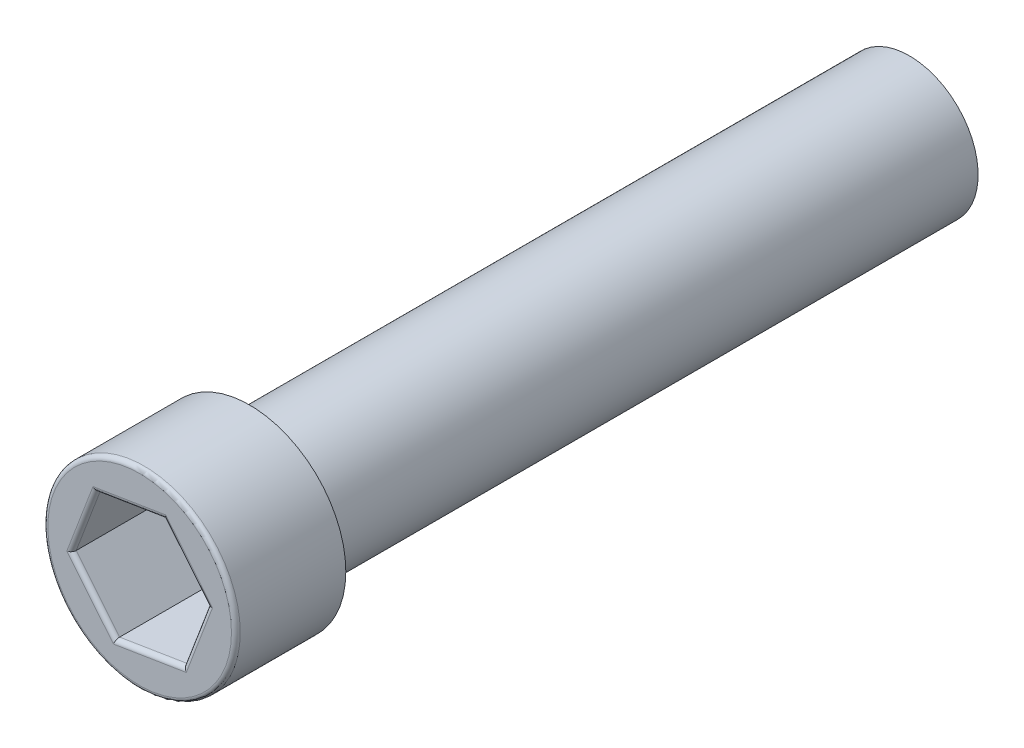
ISO-10303-21;
HEADER;
FILE_DESCRIPTION(('STEP AP214'),'2;1');
FILE_NAME('part.step','',(''),(''),'','','');
FILE_SCHEMA(('AUTOMOTIVE_DESIGN { 1 0 10303 214 1 1 1 1 }'));
ENDSEC;
DATA;
#1=APPLICATION_CONTEXT('core data for automotive mechanical design processes');
#2=APPLICATION_PROTOCOL_DEFINITION('international standard','automotive_design',2000,#1);
#3=PRODUCT_CONTEXT('',#1,'mechanical');
#4=PRODUCT('Part','Part','',(#3));
#5=PRODUCT_RELATED_PRODUCT_CATEGORY('part','',(#4));
#6=PRODUCT_DEFINITION_FORMATION('','',#4);
#7=PRODUCT_DEFINITION_CONTEXT('part definition',#1,'design');
#8=PRODUCT_DEFINITION('design','',#6,#7);
#9=PRODUCT_DEFINITION_SHAPE('','',#8);
#10=(LENGTH_UNIT() NAMED_UNIT(*) SI_UNIT(.MILLI.,.METRE.));
#11=(NAMED_UNIT(*) PLANE_ANGLE_UNIT() SI_UNIT($,.RADIAN.));
#12=(NAMED_UNIT(*) SI_UNIT($,.STERADIAN.) SOLID_ANGLE_UNIT());
#13=UNCERTAINTY_MEASURE_WITH_UNIT(LENGTH_MEASURE(1.E-05),#10,'distance_accuracy_value','');
#14=(GEOMETRIC_REPRESENTATION_CONTEXT(3) GLOBAL_UNCERTAINTY_ASSIGNED_CONTEXT((#13)) GLOBAL_UNIT_ASSIGNED_CONTEXT((#10,
#11,#12)) REPRESENTATION_CONTEXT('',''));
#15=CARTESIAN_POINT('',(0.,0.,0.));
#16=DIRECTION('',(0.,0.,1.));
#17=DIRECTION('',(1.,0.,0.));
#18=AXIS2_PLACEMENT_3D('',#15,#16,#17);
#19=CARTESIAN_POINT('',(0.,0.,44.45));
#20=DIRECTION('',(0.,0.,1.));
#21=DIRECTION('',(1.,0.,0.));
#22=AXIS2_PLACEMENT_3D('',#19,#20,#21);
#23=PLANE('',#22);
#24=DIRECTION('',(-0.354797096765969,-0.934943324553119,0.));
#25=VECTOR('',#24,1.);
#26=CARTESIAN_POINT('',(3.45091163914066,-1.30956968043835,44.45));
#27=LINE('',#26,#25);
#28=CARTESIAN_POINT('',(4.20699204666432,0.682815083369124,44.45));
#29=VERTEX_POINT('',#28);
#30=CARTESIAN_POINT('',(2.69483123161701,-3.30195444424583,44.45));
#31=VERTEX_POINT('',#30);
#32=EDGE_CURVE('E201',#29,#31,#27,.T.);
#33=ORIENTED_EDGE('',*,*,#32,.T.);
#34=DIRECTION('',(-0.987083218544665,-0.160208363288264,0.));
#35=VECTOR('',#34,1.);
#36=CARTESIAN_POINT('',(0.591335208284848,-3.64336198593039,44.45));
#37=LINE('',#36,#35);
#38=CARTESIAN_POINT('',(-1.51216081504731,-3.98476952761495,44.45));
#39=VERTEX_POINT('',#38);
#40=EDGE_CURVE('E204',#31,#39,#37,.T.);
#41=ORIENTED_EDGE('',*,*,#40,.T.);
#42=DIRECTION('',(-0.632286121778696,0.774734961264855,0.));
#43=VECTOR('',#42,1.);
#44=CARTESIAN_POINT('',(-2.85957643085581,-2.33379230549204,44.45));
#45=LINE('',#44,#43);
#46=CARTESIAN_POINT('',(-4.20699204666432,-0.682815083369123,44.45));
#47=VERTEX_POINT('',#46);
#48=EDGE_CURVE('E189',#39,#47,#45,.T.);
#49=ORIENTED_EDGE('',*,*,#48,.T.);
#50=DIRECTION('',(0.354797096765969,0.934943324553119,0.));
#51=VECTOR('',#50,1.);
#52=CARTESIAN_POINT('',(-3.45091163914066,1.30956968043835,44.45));
#53=LINE('',#52,#51);
#54=CARTESIAN_POINT('',(-2.69483123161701,3.30195444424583,44.45));
#55=VERTEX_POINT('',#54);
#56=EDGE_CURVE('E192',#47,#55,#53,.T.);
#57=ORIENTED_EDGE('',*,*,#56,.T.);
#58=DIRECTION('',(0.987083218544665,0.160208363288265,0.));
#59=VECTOR('',#58,1.);
#60=CARTESIAN_POINT('',(-0.59133520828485,3.64336198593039,44.45));
#61=LINE('',#60,#59);
#62=CARTESIAN_POINT('',(1.51216081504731,3.98476952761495,44.45));
#63=VERTEX_POINT('',#62);
#64=EDGE_CURVE('E195',#55,#63,#61,.T.);
#65=ORIENTED_EDGE('',*,*,#64,.T.);
#66=DIRECTION('',(0.632286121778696,-0.774734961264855,0.));
#67=VECTOR('',#66,1.);
#68=CARTESIAN_POINT('',(2.85957643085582,2.33379230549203,44.45));
#69=LINE('',#68,#67);
#70=EDGE_CURVE('E198',#63,#29,#69,.T.);
#71=ORIENTED_EDGE('',*,*,#70,.T.);
#72=EDGE_LOOP('',(#33,#41,#49,#57,#65,#71));
#73=FACE_BOUND('',#72,.T.);
#74=CARTESIAN_POINT('',(0.,0.,44.45));
#75=DIRECTION('',(0.,0.,1.));
#76=DIRECTION('',(1.,0.,0.));
#77=AXIS2_PLACEMENT_3D('',#74,#75,#76);
#78=CIRCLE('',#77,5.30225);
#79=CARTESIAN_POINT('',(5.30225,0.,44.45));
#80=VERTEX_POINT('',#79);
#81=EDGE_CURVE('E178',#80,#80,#78,.T.);
#82=ORIENTED_EDGE('',*,*,#81,.T.);
#83=EDGE_LOOP('',(#82));
#84=FACE_BOUND('',#83,.T.);
#85=ADVANCED_FACE('F42',(#73,#84),#23,.T.);
#86=CARTESIAN_POINT('',(0.,0.,38.1));
#87=DIRECTION('',(0.,0.,-1.));
#88=DIRECTION('',(-1.,0.,0.));
#89=AXIS2_PLACEMENT_3D('',#86,#87,#88);
#90=CYLINDRICAL_SURFACE('',#89,3.96875);
#91=CARTESIAN_POINT('',(0.,0.,38.1));
#92=DIRECTION('',(0.,0.,1.));
#93=DIRECTION('',(1.,0.,0.));
#94=AXIS2_PLACEMENT_3D('',#91,#92,#93);
#95=CIRCLE('',#94,3.96875);
#96=CARTESIAN_POINT('',(-3.96875,0.,38.1));
#97=VERTEX_POINT('',#96);
#98=EDGE_CURVE('E174',#97,#97,#95,.T.);
#99=CARTESIAN_POINT('',(0.,0.,0.));
#100=DIRECTION('',(0.,0.,1.));
#101=DIRECTION('',(1.,0.,0.));
#102=AXIS2_PLACEMENT_3D('',#99,#100,#101);
#103=CIRCLE('',#102,3.96875);
#104=CARTESIAN_POINT('',(-3.96875,0.,0.));
#105=VERTEX_POINT('',#104);
#106=EDGE_CURVE('E173',#105,#105,#103,.T.);
#107=CARTESIAN_POINT('',(-3.96875,0.,38.1));
#108=CARTESIAN_POINT('',(-3.96875,0.,37.703125));
#109=CARTESIAN_POINT('',(-3.96875,0.,37.30625));
#110=CARTESIAN_POINT('',(-3.96875,0.,36.5125));
#111=CARTESIAN_POINT('',(-3.96875,0.,36.115625));
#112=CARTESIAN_POINT('',(-3.96875,0.,35.321875));
#113=CARTESIAN_POINT('',(-3.96875,0.,34.925));
#114=CARTESIAN_POINT('',(-3.96875,0.,34.13125));
#115=CARTESIAN_POINT('',(-3.96875,0.,33.734375));
#116=CARTESIAN_POINT('',(-3.96875,0.,32.940625));
#117=CARTESIAN_POINT('',(-3.96875,0.,32.54375));
#118=CARTESIAN_POINT('',(-3.96875,0.,31.75));
#119=CARTESIAN_POINT('',(-3.96875,0.,31.353125));
#120=CARTESIAN_POINT('',(-3.96875,0.,30.559375));
#121=CARTESIAN_POINT('',(-3.96875,0.,30.1625));
#122=CARTESIAN_POINT('',(-3.96875,0.,29.36875));
#123=CARTESIAN_POINT('',(-3.96875,0.,28.971875));
#124=CARTESIAN_POINT('',(-3.96875,0.,28.178125));
#125=CARTESIAN_POINT('',(-3.96875,0.,27.78125));
#126=CARTESIAN_POINT('',(-3.96875,0.,26.9875));
#127=CARTESIAN_POINT('',(-3.96875,0.,26.590625));
#128=CARTESIAN_POINT('',(-3.96875,0.,25.796875));
#129=CARTESIAN_POINT('',(-3.96875,0.,25.4));
#130=CARTESIAN_POINT('',(-3.96875,0.,24.60625));
#131=CARTESIAN_POINT('',(-3.96875,0.,24.209375));
#132=CARTESIAN_POINT('',(-3.96875,0.,23.415625));
#133=CARTESIAN_POINT('',(-3.96875,0.,23.01875));
#134=CARTESIAN_POINT('',(-3.96875,0.,22.225));
#135=CARTESIAN_POINT('',(-3.96875,0.,21.828125));
#136=CARTESIAN_POINT('',(-3.96875,0.,21.034375));
#137=CARTESIAN_POINT('',(-3.96875,0.,20.6375));
#138=CARTESIAN_POINT('',(-3.96875,0.,19.84375));
#139=CARTESIAN_POINT('',(-3.96875,0.,19.446875));
#140=CARTESIAN_POINT('',(-3.96875,0.,18.653125));
#141=CARTESIAN_POINT('',(-3.96875,0.,18.25625));
#142=CARTESIAN_POINT('',(-3.96875,0.,17.4625));
#143=CARTESIAN_POINT('',(-3.96875,0.,17.065625));
#144=CARTESIAN_POINT('',(-3.96875,0.,16.271875));
#145=CARTESIAN_POINT('',(-3.96875,0.,15.875));
#146=CARTESIAN_POINT('',(-3.96875,0.,15.08125));
#147=CARTESIAN_POINT('',(-3.96875,0.,14.684375));
#148=CARTESIAN_POINT('',(-3.96875,0.,13.890625));
#149=CARTESIAN_POINT('',(-3.96875,0.,13.49375));
#150=CARTESIAN_POINT('',(-3.96875,0.,12.7));
#151=CARTESIAN_POINT('',(-3.96875,0.,12.303125));
#152=CARTESIAN_POINT('',(-3.96875,0.,11.509375));
#153=CARTESIAN_POINT('',(-3.96875,0.,11.1125));
#154=CARTESIAN_POINT('',(-3.96875,0.,10.31875));
#155=CARTESIAN_POINT('',(-3.96875,0.,9.921875));
#156=CARTESIAN_POINT('',(-3.96875,0.,9.128125));
#157=CARTESIAN_POINT('',(-3.96875,0.,8.73125));
#158=CARTESIAN_POINT('',(-3.96875,0.,7.9375));
#159=CARTESIAN_POINT('',(-3.96875,0.,7.540625));
#160=CARTESIAN_POINT('',(-3.96875,0.,6.746875));
#161=CARTESIAN_POINT('',(-3.96875,0.,6.35));
#162=CARTESIAN_POINT('',(-3.96875,0.,5.55625));
#163=CARTESIAN_POINT('',(-3.96875,0.,5.159375));
#164=CARTESIAN_POINT('',(-3.96875,0.,4.365625));
#165=CARTESIAN_POINT('',(-3.96875,0.,3.96875));
#166=CARTESIAN_POINT('',(-3.96875,0.,3.175));
#167=CARTESIAN_POINT('',(-3.96875,0.,2.778125));
#168=CARTESIAN_POINT('',(-3.96875,0.,1.984375));
#169=CARTESIAN_POINT('',(-3.96875,0.,1.5875));
#170=CARTESIAN_POINT('',(-3.96875,0.,0.79375));
#171=CARTESIAN_POINT('',(-3.96875,0.,0.396875));
#172=CARTESIAN_POINT('',(-3.96875,0.,0.));
#173=B_SPLINE_CURVE_WITH_KNOTS('',3,(#107,#108,#109,#110,#111,#112,#113,#114,#115,#116,#117,
#118,#119,#120,#121,#122,#123,#124,#125,#126,#127,#128,#129,#130,#131,#132,#133,#134,#135,#136,
#137,#138,#139,#140,#141,#142,#143,#144,#145,#146,#147,#148,#149,#150,#151,#152,#153,#154,#155,
#156,#157,#158,#159,#160,#161,#162,#163,#164,#165,#166,#167,#168,#169,#170,#171,#172),
.UNSPECIFIED.,.F.,.F.,(4,2,2,2,2,2,2,2,2,2,2,2,2,2,2,2,2,2,2,2,2,2,2,2,2,2,2,2,2,2,2,2,4),(0.,
1.19062499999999,2.38124999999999,3.571875,4.7625,5.953125,7.14375,8.33437499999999,9.525,
10.715625,11.90625,13.096875,14.2875,15.478125,16.66875,17.859375,19.05,20.240625,21.43125,
22.621875,23.8125,25.003125,26.19375,27.384375,28.575,29.765625,30.95625,32.146875,33.3375,
34.528125,35.71875,36.909375,38.1),.UNSPECIFIED.);
#174=EDGE_CURVE('BSEAM283',#97,#105,#173,.T.);
#175=ORIENTED_EDGE('',*,*,#98,.F.);
#176=ORIENTED_EDGE('',*,*,#106,.T.);
#177=ORIENTED_EDGE('',*,*,#174,.T.);
#178=ORIENTED_EDGE('',*,*,#174,.F.);
#179=EDGE_LOOP('',(#175,#177,#176,#178));
#180=FACE_BOUND('',#179,.T.);
#181=ADVANCED_FACE('F283',(#180),#90,.T.);
#182=CARTESIAN_POINT('',(0.,0.,0.));
#183=DIRECTION('',(0.,0.,1.));
#184=DIRECTION('',(1.,0.,0.));
#185=AXIS2_PLACEMENT_3D('',#182,#183,#184);
#186=PLANE('',#185);
#187=ORIENTED_EDGE('',*,*,#106,.F.);
#188=EDGE_LOOP('',(#187));
#189=FACE_BOUND('',#188,.T.);
#190=ADVANCED_FACE('F288',(#189),#186,.F.);
#191=CARTESIAN_POINT('',(0.,0.,44.45));
#192=DIRECTION('',(0.,0.,-1.));
#193=DIRECTION('',(-1.,0.,0.));
#194=AXIS2_PLACEMENT_3D('',#191,#192,#193);
#195=CYLINDRICAL_SURFACE('',#194,5.55625);
#196=CARTESIAN_POINT('',(0.,0.,44.196));
#197=DIRECTION('',(0.,0.,1.));
#198=DIRECTION('',(1.,0.,0.));
#199=AXIS2_PLACEMENT_3D('',#196,#197,#198);
#200=CIRCLE('',#199,5.55625);
#201=CARTESIAN_POINT('',(5.55625,0.,44.196));
#202=VERTEX_POINT('',#201);
#203=EDGE_CURVE('E185',#202,#202,#200,.F.);
#204=ORIENTED_EDGE('',*,*,#203,.T.);
#205=EDGE_LOOP('',(#204));
#206=FACE_BOUND('',#205,.T.);
#207=CARTESIAN_POINT('',(0.,0.,38.1));
#208=DIRECTION('',(0.,0.,1.));
#209=DIRECTION('',(1.,0.,0.));
#210=AXIS2_PLACEMENT_3D('',#207,#208,#209);
#211=CIRCLE('',#210,5.55625);
#212=CARTESIAN_POINT('',(5.55625,0.,38.1));
#213=VERTEX_POINT('',#212);
#214=EDGE_CURVE('E156',#213,#213,#211,.T.);
#215=ORIENTED_EDGE('',*,*,#214,.T.);
#216=EDGE_LOOP('',(#215));
#217=FACE_BOUND('',#216,.T.);
#218=ADVANCED_FACE('F297',(#206,#217),#195,.T.);
#219=CARTESIAN_POINT('',(0.,0.,38.1));
#220=DIRECTION('',(0.,0.,1.));
#221=DIRECTION('',(1.,0.,0.));
#222=AXIS2_PLACEMENT_3D('',#219,#220,#221);
#223=PLANE('',#222);
#224=ORIENTED_EDGE('',*,*,#98,.T.);
#225=EDGE_LOOP('',(#224));
#226=FACE_BOUND('',#225,.T.);
#227=ORIENTED_EDGE('',*,*,#214,.F.);
#228=EDGE_LOOP('',(#227));
#229=FACE_BOUND('',#228,.T.);
#230=ADVANCED_FACE('F294',(#226,#229),#223,.F.);
#231=CARTESIAN_POINT('',(-3.21343603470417,1.2194512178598,39.37));
#232=DIRECTION('',(0.934943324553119,-0.354797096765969,0.));
#233=DIRECTION('',(0.354797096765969,0.934943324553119,0.));
#234=AXIS2_PLACEMENT_3D('',#231,#232,#233);
#235=PLANE('',#234);
#236=DIRECTION('',(0.,0.,1.));
#237=VECTOR('',#236,1.);
#238=CARTESIAN_POINT('',(-2.5093855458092,3.07472937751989,39.37));
#239=LINE('',#238,#237);
#240=CARTESIAN_POINT('',(-2.5093855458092,3.07472937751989,39.37));
#241=VERTEX_POINT('',#240);
#242=CARTESIAN_POINT('',(-2.5093855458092,3.07472937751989,44.196));
#243=VERTEX_POINT('',#242);
#244=EDGE_CURVE('E153',#241,#243,#239,.T.);
#245=ORIENTED_EDGE('',*,*,#244,.T.);
#246=DIRECTION('',(0.354797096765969,0.934943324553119,0.));
#247=VECTOR('',#246,1.);
#248=CARTESIAN_POINT('',(-3.21343603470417,1.2194512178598,44.196));
#249=LINE('',#248,#247);
#250=CARTESIAN_POINT('',(-3.91748652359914,-0.6358269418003,44.196));
#251=VERTEX_POINT('',#250);
#252=EDGE_CURVE('E52',#243,#251,#249,.F.);
#253=ORIENTED_EDGE('',*,*,#252,.T.);
#254=DIRECTION('',(0.,0.,1.));
#255=VECTOR('',#254,1.);
#256=CARTESIAN_POINT('',(-3.91748652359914,-0.6358269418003,39.37));
#257=LINE('',#256,#255);
#258=CARTESIAN_POINT('',(-3.91748652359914,-0.6358269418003,39.37));
#259=VERTEX_POINT('',#258);
#260=EDGE_CURVE('E119',#259,#251,#257,.T.);
#261=ORIENTED_EDGE('',*,*,#260,.F.);
#262=DIRECTION('',(0.354797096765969,0.934943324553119,0.));
#263=VECTOR('',#262,1.);
#264=CARTESIAN_POINT('',(-3.21343603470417,1.2194512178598,39.37));
#265=LINE('',#264,#263);
#266=EDGE_CURVE('E128',#259,#241,#265,.T.);
#267=ORIENTED_EDGE('',*,*,#266,.T.);
#268=EDGE_LOOP('',(#245,#253,#261,#267));
#269=FACE_BOUND('',#268,.T.);
#270=ADVANCED_FACE('F131',(#269),#235,.T.);
#271=CARTESIAN_POINT('',(-0.55064228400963,3.39264284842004,39.37));
#272=DIRECTION('',(0.160208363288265,-0.987083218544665,0.));
#273=DIRECTION('',(0.987083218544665,0.160208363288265,0.));
#274=AXIS2_PLACEMENT_3D('',#271,#272,#273);
#275=PLANE('',#274);
#276=DIRECTION('',(0.,0.,1.));
#277=VECTOR('',#276,1.);
#278=CARTESIAN_POINT('',(1.40810097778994,3.71055631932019,39.37));
#279=LINE('',#278,#277);
#280=CARTESIAN_POINT('',(1.40810097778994,3.71055631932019,39.37));
#281=VERTEX_POINT('',#280);
#282=CARTESIAN_POINT('',(1.40810097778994,3.71055631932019,44.196));
#283=VERTEX_POINT('',#282);
#284=EDGE_CURVE('E157',#281,#283,#279,.T.);
#285=ORIENTED_EDGE('',*,*,#284,.T.);
#286=DIRECTION('',(0.987083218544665,0.160208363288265,0.));
#287=VECTOR('',#286,1.);
#288=CARTESIAN_POINT('',(-0.55064228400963,3.39264284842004,44.196));
#289=LINE('',#288,#287);
#290=EDGE_CURVE('E67',#283,#243,#289,.F.);
#291=ORIENTED_EDGE('',*,*,#290,.T.);
#292=ORIENTED_EDGE('',*,*,#244,.F.);
#293=DIRECTION('',(0.987083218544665,0.160208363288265,0.));
#294=VECTOR('',#293,1.);
#295=CARTESIAN_POINT('',(-0.55064228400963,3.39264284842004,39.37));
#296=LINE('',#295,#294);
#297=EDGE_CURVE('E133',#241,#281,#296,.T.);
#298=ORIENTED_EDGE('',*,*,#297,.T.);
#299=EDGE_LOOP('',(#285,#291,#292,#298));
#300=FACE_BOUND('',#299,.T.);
#301=ADVANCED_FACE('F409',(#300),#275,.T.);
#302=CARTESIAN_POINT('',(2.66279375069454,2.17319163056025,39.37));
#303=DIRECTION('',(-0.774734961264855,-0.632286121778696,0.));
#304=DIRECTION('',(0.632286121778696,-0.774734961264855,0.));
#305=AXIS2_PLACEMENT_3D('',#302,#303,#304);
#306=PLANE('',#305);
#307=DIRECTION('',(0.,0.,1.));
#308=VECTOR('',#307,1.);
#309=CARTESIAN_POINT('',(3.91748652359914,0.6358269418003,39.37));
#310=LINE('',#309,#308);
#311=CARTESIAN_POINT('',(3.91748652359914,0.6358269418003,39.37));
#312=VERTEX_POINT('',#311);
#313=CARTESIAN_POINT('',(3.91748652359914,0.6358269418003,44.196));
#314=VERTEX_POINT('',#313);
#315=EDGE_CURVE('E160',#312,#314,#310,.T.);
#316=ORIENTED_EDGE('',*,*,#315,.T.);
#317=DIRECTION('',(0.632286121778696,-0.774734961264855,0.));
#318=VECTOR('',#317,1.);
#319=CARTESIAN_POINT('',(2.66279375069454,2.17319163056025,44.196));
#320=LINE('',#319,#318);
#321=EDGE_CURVE('E215',#314,#283,#320,.F.);
#322=ORIENTED_EDGE('',*,*,#321,.T.);
#323=ORIENTED_EDGE('',*,*,#284,.F.);
#324=DIRECTION('',(0.632286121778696,-0.774734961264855,0.));
#325=VECTOR('',#324,1.);
#326=CARTESIAN_POINT('',(2.66279375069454,2.17319163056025,39.37));
#327=LINE('',#326,#325);
#328=EDGE_CURVE('E148',#281,#312,#327,.T.);
#329=ORIENTED_EDGE('',*,*,#328,.T.);
#330=EDGE_LOOP('',(#316,#322,#323,#329));
#331=FACE_BOUND('',#330,.T.);
#332=ADVANCED_FACE('F271',(#331),#306,.T.);
#333=CARTESIAN_POINT('',(3.21343603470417,-1.2194512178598,39.37));
#334=DIRECTION('',(-0.934943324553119,0.354797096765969,0.));
#335=DIRECTION('',(-0.354797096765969,-0.934943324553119,0.));
#336=AXIS2_PLACEMENT_3D('',#333,#334,#335);
#337=PLANE('',#336);
#338=DIRECTION('',(0.,0.,1.));
#339=VECTOR('',#338,1.);
#340=CARTESIAN_POINT('',(2.5093855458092,-3.07472937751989,39.37));
#341=LINE('',#340,#339);
#342=CARTESIAN_POINT('',(2.5093855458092,-3.07472937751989,39.37));
#343=VERTEX_POINT('',#342);
#344=CARTESIAN_POINT('',(2.5093855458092,-3.07472937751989,44.196));
#345=VERTEX_POINT('',#344);
#346=EDGE_CURVE('E164',#343,#345,#341,.T.);
#347=ORIENTED_EDGE('',*,*,#346,.T.);
#348=DIRECTION('',(-0.354797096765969,-0.934943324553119,0.));
#349=VECTOR('',#348,1.);
#350=CARTESIAN_POINT('',(3.21343603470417,-1.2194512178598,44.196));
#351=LINE('',#350,#349);
#352=EDGE_CURVE('E212',#345,#314,#351,.F.);
#353=ORIENTED_EDGE('',*,*,#352,.T.);
#354=ORIENTED_EDGE('',*,*,#315,.F.);
#355=DIRECTION('',(-0.354797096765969,-0.934943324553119,0.));
#356=VECTOR('',#355,1.);
#357=CARTESIAN_POINT('',(3.21343603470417,-1.2194512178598,39.37));
#358=LINE('',#357,#356);
#359=EDGE_CURVE('E145',#312,#343,#358,.T.);
#360=ORIENTED_EDGE('',*,*,#359,.T.);
#361=EDGE_LOOP('',(#347,#353,#354,#360));
#362=FACE_BOUND('',#361,.T.);
#363=ADVANCED_FACE('F267',(#362),#337,.T.);
#364=CARTESIAN_POINT('',(0.550642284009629,-3.39264284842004,39.37));
#365=DIRECTION('',(-0.160208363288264,0.987083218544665,0.));
#366=DIRECTION('',(-0.987083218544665,-0.160208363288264,0.));
#367=AXIS2_PLACEMENT_3D('',#364,#365,#366);
#368=PLANE('',#367);
#369=DIRECTION('',(0.,0.,1.));
#370=VECTOR('',#369,1.);
#371=CARTESIAN_POINT('',(-1.40810097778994,-3.71055631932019,39.37));
#372=LINE('',#371,#370);
#373=CARTESIAN_POINT('',(-1.40810097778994,-3.71055631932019,39.37));
#374=VERTEX_POINT('',#373);
#375=CARTESIAN_POINT('',(-1.40810097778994,-3.71055631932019,44.196));
#376=VERTEX_POINT('',#375);
#377=EDGE_CURVE('E122',#374,#376,#372,.T.);
#378=ORIENTED_EDGE('',*,*,#377,.T.);
#379=DIRECTION('',(-0.987083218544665,-0.160208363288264,0.));
#380=VECTOR('',#379,1.);
#381=CARTESIAN_POINT('',(0.550642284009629,-3.39264284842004,44.196));
#382=LINE('',#381,#380);
#383=EDGE_CURVE('E208',#376,#345,#382,.F.);
#384=ORIENTED_EDGE('',*,*,#383,.T.);
#385=ORIENTED_EDGE('',*,*,#346,.F.);
#386=DIRECTION('',(-0.987083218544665,-0.160208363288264,0.));
#387=VECTOR('',#386,1.);
#388=CARTESIAN_POINT('',(0.550642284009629,-3.39264284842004,39.37));
#389=LINE('',#388,#387);
#390=EDGE_CURVE('E127',#343,#374,#389,.T.);
#391=ORIENTED_EDGE('',*,*,#390,.T.);
#392=EDGE_LOOP('',(#378,#384,#385,#391));
#393=FACE_BOUND('',#392,.T.);
#394=ADVANCED_FACE('F256',(#393),#368,.T.);
#395=CARTESIAN_POINT('',(-2.66279375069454,-2.17319163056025,39.37));
#396=DIRECTION('',(0.774734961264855,0.632286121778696,0.));
#397=DIRECTION('',(-0.632286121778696,0.774734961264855,0.));
#398=AXIS2_PLACEMENT_3D('',#395,#396,#397);
#399=PLANE('',#398);
#400=ORIENTED_EDGE('',*,*,#260,.T.);
#401=DIRECTION('',(-0.632286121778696,0.774734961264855,0.));
#402=VECTOR('',#401,1.);
#403=CARTESIAN_POINT('',(-2.66279375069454,-2.17319163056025,44.196));
#404=LINE('',#403,#402);
#405=EDGE_CURVE('E11',#251,#376,#404,.F.);
#406=ORIENTED_EDGE('',*,*,#405,.T.);
#407=ORIENTED_EDGE('',*,*,#377,.F.);
#408=DIRECTION('',(-0.632286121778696,0.774734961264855,0.));
#409=VECTOR('',#408,1.);
#410=CARTESIAN_POINT('',(-2.66279375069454,-2.17319163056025,39.37));
#411=LINE('',#410,#409);
#412=EDGE_CURVE('E117',#374,#259,#411,.T.);
#413=ORIENTED_EDGE('',*,*,#412,.T.);
#414=EDGE_LOOP('',(#400,#406,#407,#413));
#415=FACE_BOUND('',#414,.T.);
#416=ADVANCED_FACE('F118',(#415),#399,.T.);
#417=CARTESIAN_POINT('',(0.,0.,39.37));
#418=DIRECTION('',(0.,0.,1.));
#419=DIRECTION('',(1.,0.,0.));
#420=AXIS2_PLACEMENT_3D('',#417,#418,#419);
#421=PLANE('',#420);
#422=ORIENTED_EDGE('',*,*,#266,.F.);
#423=ORIENTED_EDGE('',*,*,#412,.F.);
#424=ORIENTED_EDGE('',*,*,#390,.F.);
#425=ORIENTED_EDGE('',*,*,#359,.F.);
#426=ORIENTED_EDGE('',*,*,#328,.F.);
#427=ORIENTED_EDGE('',*,*,#297,.F.);
#428=EDGE_LOOP('',(#422,#423,#424,#425,#426,#427));
#429=FACE_BOUND('',#428,.T.);
#430=ADVANCED_FACE('F135',(#429),#421,.T.);
#431=CARTESIAN_POINT('',(0.,0.,44.196));
#432=DIRECTION('',(0.,0.,1.));
#433=DIRECTION('',(1.,0.,0.));
#434=AXIS2_PLACEMENT_3D('',#431,#432,#433);
#435=TOROIDAL_SURFACE('',#434,5.30225,0.254);
#436=ORIENTED_EDGE('',*,*,#203,.F.);
#437=EDGE_LOOP('',(#436));
#438=FACE_BOUND('',#437,.T.);
#439=ORIENTED_EDGE('',*,*,#81,.F.);
#440=EDGE_LOOP('',(#439));
#441=FACE_BOUND('',#440,.T.);
#442=ADVANCED_FACE('F281',(#438,#441),#435,.T.);
#443=CARTESIAN_POINT('',(-0.59133520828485,3.64336198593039,44.196));
#444=DIRECTION('',(0.987083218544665,0.160208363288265,0.));
#445=DIRECTION('',(-0.160208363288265,0.987083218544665,0.));
#446=AXIS2_PLACEMENT_3D('',#443,#444,#445);
#447=CYLINDRICAL_SURFACE('',#446,0.254);
#448=CARTESIAN_POINT('',(-2.69483123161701,3.30195444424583,44.196));
#449=DIRECTION('',(0.774734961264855,0.632286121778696,0.));
#450=DIRECTION('',(0.632286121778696,-0.774734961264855,0.));
#451=AXIS2_PLACEMENT_3D('',#448,#449,#450);
#452=ELLIPSE('',#451,0.29329393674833,0.254);
#453=EDGE_CURVE('E141',#243,#55,#452,.F.);
#454=ORIENTED_EDGE('',*,*,#453,.F.);
#455=ORIENTED_EDGE('',*,*,#290,.F.);
#456=CARTESIAN_POINT('',(1.51216081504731,3.98476952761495,44.196));
#457=DIRECTION('',(0.934943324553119,-0.354797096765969,0.));
#458=DIRECTION('',(-0.354797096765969,-0.934943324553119,0.));
#459=AXIS2_PLACEMENT_3D('',#456,#457,#458);
#460=ELLIPSE('',#459,0.29329393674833,0.254);
#461=EDGE_CURVE('E46',#63,#283,#460,.T.);
#462=ORIENTED_EDGE('',*,*,#461,.F.);
#463=ORIENTED_EDGE('',*,*,#64,.F.);
#464=EDGE_LOOP('',(#454,#455,#462,#463));
#465=FACE_BOUND('',#464,.T.);
#466=ADVANCED_FACE('F44',(#465),#447,.T.);
#467=CARTESIAN_POINT('',(2.85957643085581,2.33379230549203,44.196));
#468=DIRECTION('',(0.632286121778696,-0.774734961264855,0.));
#469=DIRECTION('',(0.774734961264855,0.632286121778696,0.));
#470=AXIS2_PLACEMENT_3D('',#467,#468,#469);
#471=CYLINDRICAL_SURFACE('',#470,0.254);
#472=ORIENTED_EDGE('',*,*,#461,.T.);
#473=ORIENTED_EDGE('',*,*,#321,.F.);
#474=CARTESIAN_POINT('',(4.20699204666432,0.682815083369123,44.196));
#475=DIRECTION('',(0.160208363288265,-0.987083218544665,0.));
#476=DIRECTION('',(-0.987083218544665,-0.160208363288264,0.));
#477=AXIS2_PLACEMENT_3D('',#474,#475,#476);
#478=ELLIPSE('',#477,0.29329393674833,0.254);
#479=EDGE_CURVE('E232',#29,#314,#478,.T.);
#480=ORIENTED_EDGE('',*,*,#479,.F.);
#481=ORIENTED_EDGE('',*,*,#70,.F.);
#482=EDGE_LOOP('',(#472,#473,#480,#481));
#483=FACE_BOUND('',#482,.T.);
#484=ADVANCED_FACE('F274',(#483),#471,.T.);
#485=CARTESIAN_POINT('',(-3.45091163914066,1.30956968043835,44.196));
#486=DIRECTION('',(0.354797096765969,0.934943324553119,0.));
#487=DIRECTION('',(-0.934943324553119,0.354797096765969,0.));
#488=AXIS2_PLACEMENT_3D('',#485,#486,#487);
#489=CYLINDRICAL_SURFACE('',#488,0.254);
#490=ORIENTED_EDGE('',*,*,#453,.T.);
#491=ORIENTED_EDGE('',*,*,#56,.F.);
#492=CARTESIAN_POINT('',(-4.20699204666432,-0.682815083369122,44.196));
#493=DIRECTION('',(-0.160208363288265,0.987083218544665,0.));
#494=DIRECTION('',(0.987083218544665,0.160208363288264,0.));
#495=AXIS2_PLACEMENT_3D('',#492,#493,#494);
#496=ELLIPSE('',#495,0.29329393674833,0.254);
#497=EDGE_CURVE('E228',#251,#47,#496,.F.);
#498=ORIENTED_EDGE('',*,*,#497,.F.);
#499=ORIENTED_EDGE('',*,*,#252,.F.);
#500=EDGE_LOOP('',(#490,#491,#498,#499));
#501=FACE_BOUND('',#500,.T.);
#502=ADVANCED_FACE('F240',(#501),#489,.T.);
#503=CARTESIAN_POINT('',(3.45091163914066,-1.30956968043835,44.196));
#504=DIRECTION('',(-0.354797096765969,-0.934943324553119,0.));
#505=DIRECTION('',(0.934943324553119,-0.354797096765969,0.));
#506=AXIS2_PLACEMENT_3D('',#503,#504,#505);
#507=CYLINDRICAL_SURFACE('',#506,0.254);
#508=ORIENTED_EDGE('',*,*,#479,.T.);
#509=ORIENTED_EDGE('',*,*,#352,.F.);
#510=CARTESIAN_POINT('',(2.694831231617,-3.30195444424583,44.196));
#511=DIRECTION('',(-0.774734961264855,-0.632286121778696,0.));
#512=DIRECTION('',(-0.632286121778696,0.774734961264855,0.));
#513=AXIS2_PLACEMENT_3D('',#510,#511,#512);
#514=ELLIPSE('',#513,0.29329393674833,0.254);
#515=EDGE_CURVE('E225',#31,#345,#514,.T.);
#516=ORIENTED_EDGE('',*,*,#515,.F.);
#517=ORIENTED_EDGE('',*,*,#32,.F.);
#518=EDGE_LOOP('',(#508,#509,#516,#517));
#519=FACE_BOUND('',#518,.T.);
#520=ADVANCED_FACE('F264',(#519),#507,.T.);
#521=CARTESIAN_POINT('',(-2.85957643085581,-2.33379230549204,44.196));
#522=DIRECTION('',(-0.632286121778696,0.774734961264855,0.));
#523=DIRECTION('',(-0.774734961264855,-0.632286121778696,0.));
#524=AXIS2_PLACEMENT_3D('',#521,#522,#523);
#525=CYLINDRICAL_SURFACE('',#524,0.254);
#526=ORIENTED_EDGE('',*,*,#497,.T.);
#527=ORIENTED_EDGE('',*,*,#48,.F.);
#528=CARTESIAN_POINT('',(-1.51216081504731,-3.98476952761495,44.196));
#529=DIRECTION('',(-0.934943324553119,0.354797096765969,0.));
#530=DIRECTION('',(-0.354797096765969,-0.934943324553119,0.));
#531=AXIS2_PLACEMENT_3D('',#528,#529,#530);
#532=ELLIPSE('',#531,0.29329393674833,0.254);
#533=EDGE_CURVE('E222',#376,#39,#532,.F.);
#534=ORIENTED_EDGE('',*,*,#533,.F.);
#535=ORIENTED_EDGE('',*,*,#405,.F.);
#536=EDGE_LOOP('',(#526,#527,#534,#535));
#537=FACE_BOUND('',#536,.T.);
#538=ADVANCED_FACE('F252',(#537),#525,.T.);
#539=CARTESIAN_POINT('',(0.591335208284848,-3.64336198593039,44.196));
#540=DIRECTION('',(-0.987083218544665,-0.160208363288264,0.));
#541=DIRECTION('',(0.160208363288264,-0.987083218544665,0.));
#542=AXIS2_PLACEMENT_3D('',#539,#540,#541);
#543=CYLINDRICAL_SURFACE('',#542,0.254);
#544=ORIENTED_EDGE('',*,*,#515,.T.);
#545=ORIENTED_EDGE('',*,*,#383,.F.);
#546=ORIENTED_EDGE('',*,*,#533,.T.);
#547=ORIENTED_EDGE('',*,*,#40,.F.);
#548=EDGE_LOOP('',(#544,#545,#546,#547));
#549=FACE_BOUND('',#548,.T.);
#550=ADVANCED_FACE('F259',(#549),#543,.T.);
#551=CLOSED_SHELL('',(#85,#181,#190,#218,#230,#270,#301,#332,#363,#394,#416,#430,#442,#466,#484,
#502,#520,#538,#550));
#552=MANIFOLD_SOLID_BREP('B2',#551);
#553=ADVANCED_BREP_SHAPE_REPRESENTATION('',(#18,#552),#14);
#554=SHAPE_DEFINITION_REPRESENTATION(#9,#553);
ENDSEC;
END-ISO-10303-21;
